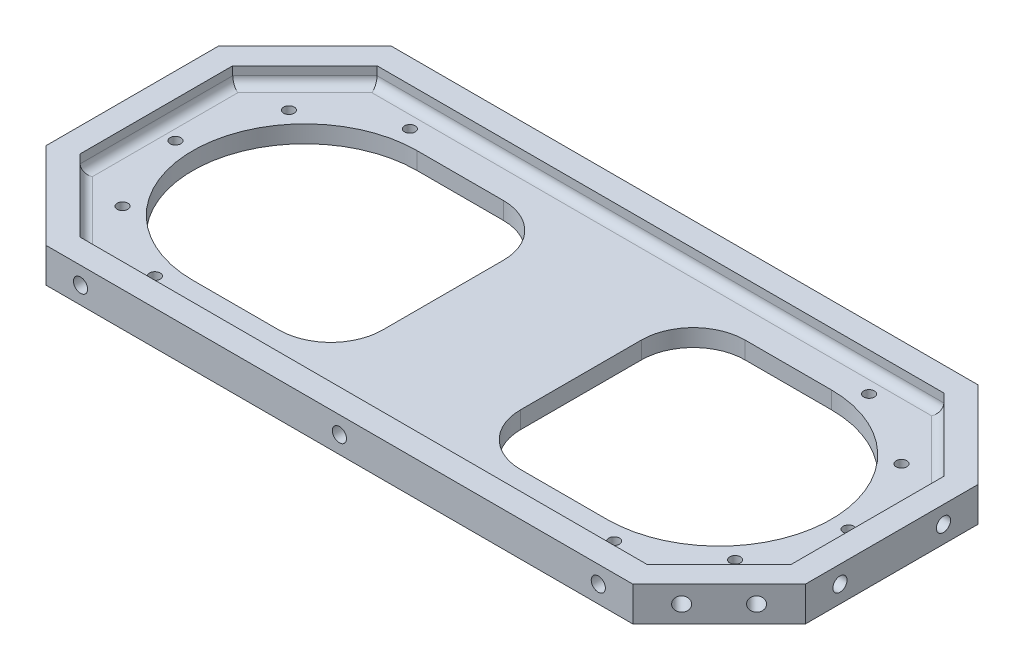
from build123d import *

# Parameters (mm, degrees)
MAIN_DEPTH                                     = 10
SKETCH3_R                                      = 1.55
ACTUATOR_SCREW_HOLE_DEPTH                      = 141.91220671
ACTUATOR_SCREW_HOLE_PATTERN_COUNT              = 3
ACTUATOR_SCREW_HOLE_PATTERN_ANGLE              = 80
ACTUATOR_SCREW_HOLE_PATTERN_THE_OTHER_WA_COUNT = 3
ACTUATOR_SCREW_HOLE_PATTERN_THE_OTHER_WA_ANGLE = 80
MIDSPAN_FILLET_R                               = 15
DISH_DEPTH                                     = 5
DISH_FILLET_R                                  = 2.5
F_4_0MM_DOWEL_HOLE1_D                          = 4.1
F_4_0MM_DOWEL_HOLE1_DEPTH                      = 5.7
F_4_0MM_DOWEL_HOLE1_ON_FACE_2_D                = 4.1
F_4_0MM_DOWEL_HOLE1_ON_FACE_2_DEPTH            = 5.7
F_4_0MM_DOWEL_HOLE1_ON_FACE_3_D                = 4.1
F_4_0MM_DOWEL_HOLE1_ON_FACE_3_DEPTH            = 5.7
F_4_0MM_DOWEL_HOLE1_ON_FACE_4_D                = 4.1
F_4_0MM_DOWEL_HOLE1_ON_FACE_4_DEPTH            = 5.7
F_4_0MM_DOWEL_HOLE1_ON_FACE_5_D                = 4.1
F_4_0MM_DOWEL_HOLE1_ON_FACE_5_DEPTH            = 5.7
F_4_0MM_DOWEL_HOLE1_ON_FACE_6_D                = 4.1
F_4_0MM_DOWEL_HOLE1_ON_FACE_6_DEPTH            = 5.7
F_4_0MM_DOWEL_HOLE1_ON_FACE_7_D                = 4.1
F_4_0MM_DOWEL_HOLE1_ON_FACE_7_DEPTH            = 5.7
F_4_0MM_DOWEL_HOLE1_ON_FACE_8_D                = 4.1
F_4_0MM_DOWEL_HOLE1_ON_FACE_8_DEPTH            = 5.7
F_4_0MM_DOWEL_HOLE1_ON_FACE_9_D                = 4.1
F_4_0MM_DOWEL_HOLE1_ON_FACE_9_DEPTH            = 5.7
F_4_0MM_DOWEL_HOLE1_ON_FACE_10_D               = 4.1
F_4_0MM_DOWEL_HOLE1_ON_FACE_10_DEPTH           = 5.7


with BuildPart() as part:
    # Sketch1 → Main (new body)
    with BuildSketch(Plane(origin=(0, 0, 0), x_dir=(1, 0, 0), z_dir=(0, 1, 0))):
        Polygon((0, 12.5), (0, 0), (0, -75), (0, -87.5), (85, -87.5), (110, -62.5), (110, -12.5), (85, 12.5), align=None)
        with BuildLine():
            Line((60, -5), (20, -5))
            Line((20, -5), (20, -70))
            Line((20, -70), (60, -70))
            ThreePointArc((60, -70), (92.5, -37.5), (60, -5))
        make_face(mode=Mode.SUBTRACT)
    extrude(amount=MAIN_DEPTH)

    # Sketch3 → Actuator Screw Hole (cut, through all)
    with BuildSketch(Plane(origin=(0, 10, 0), x_dir=(1, 0, 0), z_dir=(0, 1, 0))):
        with Locations(Location((97.5, -37.5, 0), (0, 0, 270))):
            Circle(SKETCH3_R)
    actuator_screw_hole = extrude(amount=-ACTUATOR_SCREW_HOLE_DEPTH, mode=Mode.SUBTRACT)

    # Actuator Screw Hole Pattern: Actuator Screw Hole ×3 about axis
    actuator_screw_hole_pattern_axis = Axis((60, 0, 37.5), (0, 1, 0))
    for i in range(1, ACTUATOR_SCREW_HOLE_PATTERN_COUNT):
        add(actuator_screw_hole.rotate(actuator_screw_hole_pattern_axis, i * ACTUATOR_SCREW_HOLE_PATTERN_ANGLE / (ACTUATOR_SCREW_HOLE_PATTERN_COUNT - 1)), mode=Mode.SUBTRACT)

    # Actuator Screw Hole Pattern the other wa: Actuator Screw Hole ×3 about axis
    actuator_screw_hole_pattern_the_other_wa_axis = Axis((60, 0, 37.5), (0, -1, 0))
    for i in range(1, ACTUATOR_SCREW_HOLE_PATTERN_THE_OTHER_WA_COUNT):
        add(actuator_screw_hole.rotate(actuator_screw_hole_pattern_the_other_wa_axis, i * ACTUATOR_SCREW_HOLE_PATTERN_THE_OTHER_WA_ANGLE / (ACTUATOR_SCREW_HOLE_PATTERN_THE_OTHER_WA_COUNT - 1)), mode=Mode.SUBTRACT)

    # Midspan fillet
    midspan_fillet_edges = [part.edges().sort_by_distance(p)[0] for p in [
        (20, 5, 5),
        (20, 5, 70),
    ]]
    fillet(midspan_fillet_edges, radius=MIDSPAN_FILLET_R)

    # Mirror1: part across plane


with BuildPart() as part_1:
    add(part.part)
    add(part.part.mirror(Plane(origin=(0, 0, 0), x_dir=(0, 0, 1), z_dir=(1, 0, 0))))

    # Sketch8 → Dish (cut)
    with BuildSketch(Plane(origin=(0, 10, 0), x_dir=(1, 0, 0), z_dir=(0, 1, 0))):
        Polygon((82.100505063, 5.5), (-82.100505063, 5.5), (-103, -15.399494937), (-103, -59.600505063), (-82.100505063, -80.5), (82.100505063, -80.5), (103, -59.600505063), (103, -15.399494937), align=None)
    extrude(amount=-DISH_DEPTH, mode=Mode.SUBTRACT)

    # Dish fillet
    dish_fillet_edges = [part_1.edges().sort_by_distance(p)[0] for p in [
        (92.550252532, 5, 4.949747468),
        (103, 5, 37.5),
        (92.550252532, 5, 70.050252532),
        (0, 5, 80.5),
        (-92.550252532, 5, 70.050252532),
        (-103, 5, 37.5),
        (-92.550252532, 5, 4.949747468),
        (0, 5, -5.5),
    ]]
    fillet(dish_fillet_edges, radius=DISH_FILLET_R)

    # 4.0mm Dowel Hole1
    with Locations(Plane(origin=(75, 5, -12.5), x_dir=(-1, 0, 0), z_dir=(0, 0, -1))):
        with Locations((0, 0), (75, 0), (150, 0)):
            Hole(F_4_0MM_DOWEL_HOLE1_D / 2, depth=F_4_0MM_DOWEL_HOLE1_DEPTH)

    # 4.0mm Dowel Hole1 on face 2
    with Locations(Plane(origin=(-92.071067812, 5, -5.428932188), x_dir=(-0.707106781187, 0, 0.707106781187), z_dir=(-0.707106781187, 0, -0.707106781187))):
        with Locations((0, 0), (15.355339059, 0)):
            Hole(F_4_0MM_DOWEL_HOLE1_ON_FACE_2_D / 2, depth=F_4_0MM_DOWEL_HOLE1_ON_FACE_2_DEPTH)

    # 4.0mm Dowel Hole1 on face 3
    with Locations(Plane(origin=(-110, 5, 22.5), x_dir=(0, 0, -1), z_dir=(-1, 0, 0))):
        with Locations((0, 0), (-30, 0)):
            Hole(F_4_0MM_DOWEL_HOLE1_ON_FACE_3_D / 2, depth=F_4_0MM_DOWEL_HOLE1_ON_FACE_3_DEPTH)

    # 4.0mm Dowel Hole1 on face 4
    with Locations(Plane(origin=(-102.928932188, 5, 69.571067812), x_dir=(0.707106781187, 0, 0.707106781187), z_dir=(-0.707106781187, 0, 0.707106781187))):
        with Locations((0, 0)):
            Hole(F_4_0MM_DOWEL_HOLE1_ON_FACE_4_D / 2, depth=F_4_0MM_DOWEL_HOLE1_ON_FACE_4_DEPTH)

    # 4.0mm Dowel Hole1 on face 5
    with Locations(Plane(origin=(-92.071067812, 5, 80.428932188), x_dir=(0.707106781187, 0, 0.707106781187), z_dir=(-0.707106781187, 0, 0.707106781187))):
        with Locations((0, 0)):
            Hole(F_4_0MM_DOWEL_HOLE1_ON_FACE_5_D / 2, depth=F_4_0MM_DOWEL_HOLE1_ON_FACE_5_DEPTH)

    # 4.0mm Dowel Hole1 on face 6
    with Locations(Plane(origin=(-75, 5, 87.5), x_dir=(1, 0, 0), z_dir=(0, 0, 1))):
        with Locations((0, 0), (75, 0), (150, 0)):
            Hole(F_4_0MM_DOWEL_HOLE1_ON_FACE_6_D / 2, depth=F_4_0MM_DOWEL_HOLE1_ON_FACE_6_DEPTH)

    # 4.0mm Dowel Hole1 on face 7
    with Locations(Plane(origin=(92.071067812, 5, 80.428932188), x_dir=(0.707106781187, 0, -0.707106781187), z_dir=(0.707106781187, 0, 0.707106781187))):
        with Locations((0, 0)):
            Hole(F_4_0MM_DOWEL_HOLE1_ON_FACE_7_D / 2, depth=F_4_0MM_DOWEL_HOLE1_ON_FACE_7_DEPTH)

    # 4.0mm Dowel Hole1 on face 8
    with Locations(Plane(origin=(102.928932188, 5, 69.571067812), x_dir=(0.707106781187, 0, -0.707106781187), z_dir=(0.707106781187, 0, 0.707106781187))):
        with Locations((0, 0)):
            Hole(F_4_0MM_DOWEL_HOLE1_ON_FACE_8_D / 2, depth=F_4_0MM_DOWEL_HOLE1_ON_FACE_8_DEPTH)

    # 4.0mm Dowel Hole1 on face 9
    with Locations(Plane(origin=(110, 5, 52.5), x_dir=(0, 0, 1), z_dir=(1, 0, 0))):
        with Locations((0, 0), (-30, 0)):
            Hole(F_4_0MM_DOWEL_HOLE1_ON_FACE_9_D / 2, depth=F_4_0MM_DOWEL_HOLE1_ON_FACE_9_DEPTH)

    # 4.0mm Dowel Hole1 on face 10
    with Locations(Plane(origin=(102.928932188, 5, 5.428932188), x_dir=(-0.707106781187, 0, -0.707106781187), z_dir=(0.707106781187, 0, -0.707106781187))):
        with Locations((0, 0), (15.355339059, 0)):
            Hole(F_4_0MM_DOWEL_HOLE1_ON_FACE_10_D / 2, depth=F_4_0MM_DOWEL_HOLE1_ON_FACE_10_DEPTH)


solid = part_1.part
